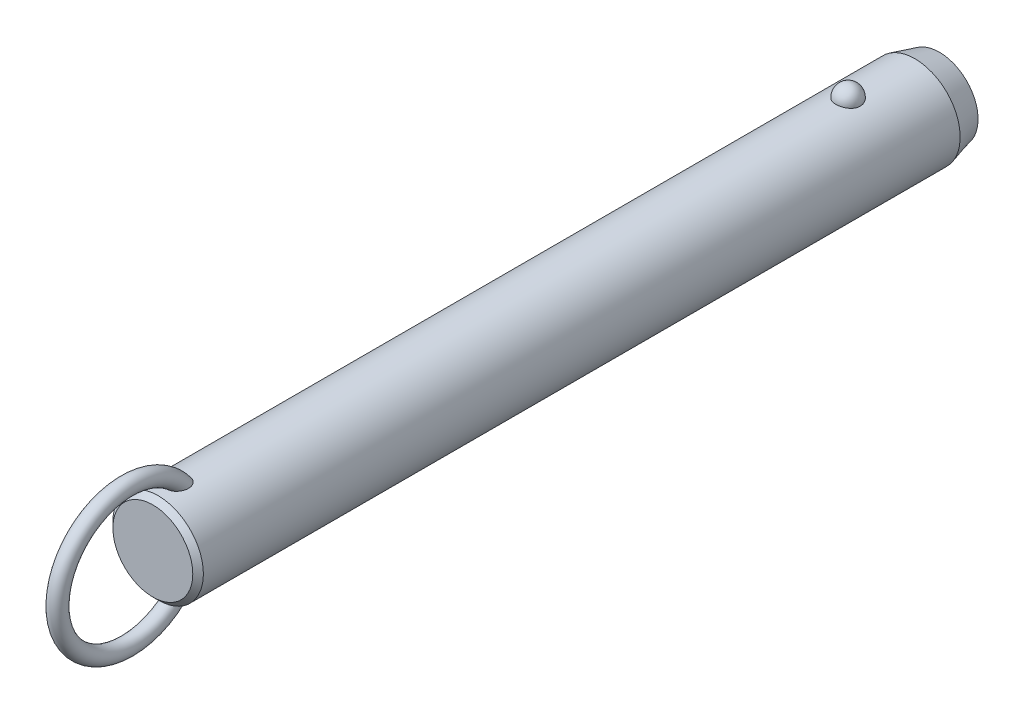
ISO-10303-21;
HEADER;
FILE_DESCRIPTION(('STEP AP214'),'2;1');
FILE_NAME('part.step','',(''),(''),'','','');
FILE_SCHEMA(('AUTOMOTIVE_DESIGN { 1 0 10303 214 1 1 1 1 }'));
ENDSEC;
DATA;
#1=APPLICATION_CONTEXT('core data for automotive mechanical design processes');
#2=APPLICATION_PROTOCOL_DEFINITION('international standard','automotive_design',2000,#1);
#3=PRODUCT_CONTEXT('',#1,'mechanical');
#4=PRODUCT('Part','Part','',(#3));
#5=PRODUCT_RELATED_PRODUCT_CATEGORY('part','',(#4));
#6=PRODUCT_DEFINITION_FORMATION('','',#4);
#7=PRODUCT_DEFINITION_CONTEXT('part definition',#1,'design');
#8=PRODUCT_DEFINITION('design','',#6,#7);
#9=PRODUCT_DEFINITION_SHAPE('','',#8);
#10=(LENGTH_UNIT() NAMED_UNIT(*) SI_UNIT(.MILLI.,.METRE.));
#11=(NAMED_UNIT(*) PLANE_ANGLE_UNIT() SI_UNIT($,.RADIAN.));
#12=(NAMED_UNIT(*) SI_UNIT($,.STERADIAN.) SOLID_ANGLE_UNIT());
#13=UNCERTAINTY_MEASURE_WITH_UNIT(LENGTH_MEASURE(1.E-05),#10,'distance_accuracy_value','');
#14=(GEOMETRIC_REPRESENTATION_CONTEXT(3) GLOBAL_UNCERTAINTY_ASSIGNED_CONTEXT((#13)) GLOBAL_UNIT_ASSIGNED_CONTEXT((#10,
#11,#12)) REPRESENTATION_CONTEXT('',''));
#15=CARTESIAN_POINT('',(0.,0.,0.));
#16=DIRECTION('',(0.,0.,1.));
#17=DIRECTION('',(1.,0.,0.));
#18=AXIS2_PLACEMENT_3D('',#15,#16,#17);
#19=CARTESIAN_POINT('',(0.,0.,154.9));
#20=DIRECTION('',(0.,0.,-1.));
#21=DIRECTION('',(-1.,0.,0.));
#22=AXIS2_PLACEMENT_3D('',#19,#20,#21);
#23=CYLINDRICAL_SURFACE('',#22,11.1);
#24=CARTESIAN_POINT('',(2.9724815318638,10.6945945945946,-3.00000000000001));
#25=CARTESIAN_POINT('',(2.97247830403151,10.6945972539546,-2.8322505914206));
#26=CARTESIAN_POINT('',(2.95876598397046,10.6984356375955,-2.66445972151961));
#27=CARTESIAN_POINT('',(2.90424529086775,10.7133624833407,-2.3336238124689));
#28=CARTESIAN_POINT('',(2.8634252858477,10.7244540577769,-2.17058084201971));
#29=CARTESIAN_POINT('',(2.75573657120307,10.7526272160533,-1.85396767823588));
#30=CARTESIAN_POINT('',(2.68887937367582,10.7697061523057,-1.70039333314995));
#31=CARTESIAN_POINT('',(2.53079696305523,10.8079438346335,-1.4069159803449));
#32=CARTESIAN_POINT('',(2.43957264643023,10.8291024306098,-1.26701246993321));
#33=CARTESIAN_POINT('',(2.23458150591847,10.8732541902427,-1.00409565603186));
#34=CARTESIAN_POINT('',(2.12071295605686,10.8962553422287,-0.881162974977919));
#35=CARTESIAN_POINT('',(1.87365402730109,10.9414421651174,-0.656352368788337));
#36=CARTESIAN_POINT('',(1.74046358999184,10.9636278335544,-0.554474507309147));
#37=CARTESIAN_POINT('',(1.45872188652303,11.0046495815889,-0.374872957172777));
#38=CARTESIAN_POINT('',(1.31021276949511,11.0234944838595,-0.297085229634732));
#39=CARTESIAN_POINT('',(1.00170030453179,11.0557957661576,-0.167529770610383));
#40=CARTESIAN_POINT('',(0.841698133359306,11.0692526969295,-0.1157593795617));
#41=CARTESIAN_POINT('',(0.517607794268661,11.0890932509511,-0.0403925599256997));
#42=CARTESIAN_POINT('',(0.353633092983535,11.0955916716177,-0.0163383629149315));
#43=CARTESIAN_POINT('',(0.0238420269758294,11.1011989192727,0.00445177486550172));
#44=CARTESIAN_POINT('',(-0.141974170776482,11.1003084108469,0.00119017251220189));
#45=CARTESIAN_POINT('',(-0.468405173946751,11.0912990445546,-0.0323233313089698));
#46=CARTESIAN_POINT('',(-0.629059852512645,11.0832767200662,-0.062214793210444));
#47=CARTESIAN_POINT('',(-0.942937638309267,11.0609962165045,-0.147645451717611));
#48=CARTESIAN_POINT('',(-1.09616062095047,11.0467379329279,-0.203185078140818));
#49=CARTESIAN_POINT('',(-1.39181061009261,11.0134071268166,-0.338752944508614));
#50=CARTESIAN_POINT('',(-1.53417383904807,10.9943086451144,-0.418913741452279));
#51=CARTESIAN_POINT('',(-1.80342160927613,10.9533667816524,-0.601448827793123));
#52=CARTESIAN_POINT('',(-1.9303046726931,10.9315231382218,-0.703825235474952));
#53=CARTESIAN_POINT('',(-2.16747598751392,10.887005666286,-0.930091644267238));
#54=CARTESIAN_POINT('',(-2.27742774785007,10.8643239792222,-1.05433291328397));
#55=CARTESIAN_POINT('',(-2.47517316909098,10.8209886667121,-1.31966633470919));
#56=CARTESIAN_POINT('',(-2.56296538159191,10.8003351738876,-1.46075958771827));
#57=CARTESIAN_POINT('',(-2.71500300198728,10.7631304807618,-1.75753646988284));
#58=CARTESIAN_POINT('',(-2.77898901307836,10.7466250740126,-1.91335887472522));
#59=CARTESIAN_POINT('',(-2.88046189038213,10.7198747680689,-2.23391529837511));
#60=CARTESIAN_POINT('',(-2.91794947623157,10.709629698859,-2.3986490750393));
#61=CARTESIAN_POINT('',(-2.96537819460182,10.6965949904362,-2.73165170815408));
#62=CARTESIAN_POINT('',(-2.97542891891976,10.693775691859,-2.89990378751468));
#63=CARTESIAN_POINT('',(-2.96804271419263,10.6958279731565,-3.23575286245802));
#64=CARTESIAN_POINT('',(-2.95060646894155,10.7006993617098,-3.4033498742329));
#65=CARTESIAN_POINT('',(-2.88883358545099,10.71753912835,-3.73233906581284));
#66=CARTESIAN_POINT('',(-2.84462026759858,10.7294749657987,-3.89375610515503));
#67=CARTESIAN_POINT('',(-2.73050447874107,10.7590797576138,-4.20667949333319));
#68=CARTESIAN_POINT('',(-2.66060103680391,10.7767489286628,-4.35818546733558));
#69=CARTESIAN_POINT('',(-2.49642559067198,10.8159599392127,-4.64785421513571));
#70=CARTESIAN_POINT('',(-2.40203047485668,10.8375211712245,-4.78594458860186));
#71=CARTESIAN_POINT('',(-2.19143488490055,10.8820570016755,-5.04410382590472));
#72=CARTESIAN_POINT('',(-2.07523364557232,10.9050316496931,-5.16417205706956));
#73=CARTESIAN_POINT('',(-1.82361254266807,10.9499219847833,-5.3833483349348));
#74=CARTESIAN_POINT('',(-1.68812945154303,10.9718338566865,-5.48238464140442));
#75=CARTESIAN_POINT('',(-1.40191298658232,11.0120611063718,-5.65618873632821));
#76=CARTESIAN_POINT('',(-1.25118062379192,11.0303767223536,-5.73095813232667));
#77=CARTESIAN_POINT('',(-0.940570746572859,11.0611653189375,-5.85334725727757));
#78=CARTESIAN_POINT('',(-0.780821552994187,11.0737044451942,-5.90127578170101));
#79=CARTESIAN_POINT('',(-0.455204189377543,11.0918598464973,-5.96992976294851));
#80=CARTESIAN_POINT('',(-0.289336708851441,11.0974768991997,-5.99065827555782));
#81=CARTESIAN_POINT('',(0.0406846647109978,11.1011307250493,-6.00418773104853));
#82=CARTESIAN_POINT('',(0.204817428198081,11.099299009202,-5.9974731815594));
#83=CARTESIAN_POINT('',(0.5295530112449,11.088551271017,-5.95740317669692));
#84=CARTESIAN_POINT('',(0.69015594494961,11.0796354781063,-5.92404858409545));
#85=CARTESIAN_POINT('',(1.0027760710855,11.0557204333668,-5.83180084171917));
#86=CARTESIAN_POINT('',(1.15482001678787,11.0407414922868,-5.7729929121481));
#87=CARTESIAN_POINT('',(1.44678373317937,11.0062913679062,-5.63147366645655));
#88=CARTESIAN_POINT('',(1.58670279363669,10.9868199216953,-5.54876095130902));
#89=CARTESIAN_POINT('',(1.8527023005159,10.9451315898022,-5.36027644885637));
#90=CARTESIAN_POINT('',(1.97855158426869,10.9228788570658,-5.25418644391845));
#91=CARTESIAN_POINT('',(2.21080872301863,10.8782509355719,-5.02251354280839));
#92=CARTESIAN_POINT('',(2.31721312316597,10.8558757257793,-4.89692718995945));
#93=CARTESIAN_POINT('',(2.5094551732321,10.8130715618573,-4.62745408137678));
#94=CARTESIAN_POINT('',(2.59493284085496,10.7926798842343,-4.48330448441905));
#95=CARTESIAN_POINT('',(2.740862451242,10.7565495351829,-4.18236358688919));
#96=CARTESIAN_POINT('',(2.80132490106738,10.7408089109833,-4.02557762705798));
#97=CARTESIAN_POINT('',(2.88959070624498,10.7173718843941,-3.72475308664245));
#98=CARTESIAN_POINT('',(2.92062102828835,10.7088950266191,-3.58171216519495));
#99=CARTESIAN_POINT('',(2.96206765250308,10.6975052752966,-3.29245795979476));
#100=CARTESIAN_POINT('',(2.97248434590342,10.6945922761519,-3.14624473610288));
#101=CARTESIAN_POINT('',(2.9724815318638,10.6945945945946,-3.00000000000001));
#102=B_SPLINE_CURVE_WITH_KNOTS('',3,(#24,#25,#26,#27,#28,#29,#30,#31,#32,#33,#34,#35,#36,#37,
#38,#39,#40,#41,#42,#43,#44,#45,#46,#47,#48,#49,#50,#51,#52,#53,#54,#55,#56,#57,#58,#59,#60,#61,
#62,#63,#64,#65,#66,#67,#68,#69,#70,#71,#72,#73,#74,#75,#76,#77,#78,#79,#80,#81,#82,#83,#84,#85,
#86,#87,#88,#89,#90,#91,#92,#93,#94,#95,#96,#97,#98,#99,#100,#101),.UNSPECIFIED.,.T.,.F.,(4,2,2,
2,2,2,2,2,2,2,2,2,2,2,2,2,2,2,2,2,2,2,2,2,2,2,2,2,2,2,2,2,2,2,2,2,2,2,4),(0.,0.502722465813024,
1.00566079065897,1.5083769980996,2.01107471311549,2.51608392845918,3.02109467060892,
3.52475118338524,4.02835620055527,4.523518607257,5.0186364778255,5.50715297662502,
5.9956776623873,6.48688002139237,6.97812923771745,7.47814366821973,7.9781907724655,
8.48353712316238,8.9888697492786,9.49218093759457,9.99547960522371,10.4964777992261,
10.997494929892,11.5010810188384,12.0046847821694,12.5099796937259,13.0152411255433,
13.5145635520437,14.0138298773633,14.5043200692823,14.9947943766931,15.4836390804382,
15.9725123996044,16.4685040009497,16.9645836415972,17.4686765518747,17.972557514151,
18.410841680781,18.849117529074),.UNSPECIFIED.);
#103=CARTESIAN_POINT('',(2.9724815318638,10.6945945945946,-3.00000000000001));
#104=VERTEX_POINT('',#103);
#105=EDGE_CURVE('E41',#104,#104,#102,.T.);
#106=ORIENTED_EDGE('',*,*,#105,.T.);
#107=EDGE_LOOP('',(#106));
#108=FACE_BOUND('',#107,.T.);
#109=CARTESIAN_POINT('',(0.,0.,166.3));
#110=DIRECTION('',(0.,0.,1.));
#111=DIRECTION('',(1.,0.,0.));
#112=AXIS2_PLACEMENT_3D('',#109,#110,#111);
#113=CIRCLE('',#112,11.1);
#114=CARTESIAN_POINT('',(11.1,0.,166.3));
#115=VERTEX_POINT('',#114);
#116=EDGE_CURVE('E10',#115,#115,#113,.F.);
#117=ORIENTED_EDGE('',*,*,#116,.T.);
#118=EDGE_LOOP('',(#117));
#119=FACE_BOUND('',#118,.T.);
#120=CARTESIAN_POINT('',(-0.564520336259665,-11.0856356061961,158.557815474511));
#121=CARTESIAN_POINT('',(-0.667202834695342,-11.0804062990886,158.591283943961));
#122=CARTESIAN_POINT('',(-0.766875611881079,-11.0738877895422,158.633835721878));
#123=CARTESIAN_POINT('',(-0.957284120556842,-11.0590576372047,158.735419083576));
#124=CARTESIAN_POINT('',(-1.04801616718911,-11.0507452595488,158.79445742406));
#125=CARTESIAN_POINT('',(-1.21800952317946,-11.0333016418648,158.926529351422));
#126=CARTESIAN_POINT('',(-1.29730805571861,-11.0241732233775,158.999515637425));
#127=CARTESIAN_POINT('',(-1.44337665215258,-11.0060026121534,159.157037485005));
#128=CARTESIAN_POINT('',(-1.51014622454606,-10.9969604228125,159.241573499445));
#129=CARTESIAN_POINT('',(-1.63454620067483,-10.9791841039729,159.425521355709));
#130=CARTESIAN_POINT('',(-1.69127003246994,-10.9705107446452,159.525549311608));
#131=CARTESIAN_POINT('',(-1.7898078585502,-10.9548648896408,159.732790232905));
#132=CARTESIAN_POINT('',(-1.83161214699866,-10.9478935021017,159.840007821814));
#133=CARTESIAN_POINT('',(-1.91557028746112,-10.9335803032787,160.105408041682));
#134=CARTESIAN_POINT('',(-1.95040620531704,-10.9273269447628,160.265980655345));
#135=CARTESIAN_POINT('',(-1.99388326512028,-10.9194709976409,160.590697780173));
#136=CARTESIAN_POINT('',(-2.00248051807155,-10.9178762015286,160.754847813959));
#137=CARTESIAN_POINT('',(-1.99551615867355,-10.9191578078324,161.124650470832));
#138=CARTESIAN_POINT('',(-1.97322066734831,-10.9232807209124,161.330191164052));
#139=CARTESIAN_POINT('',(-1.91529761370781,-10.9335244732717,161.633595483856));
#140=CARTESIAN_POINT('',(-1.89184575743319,-10.9376266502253,161.734088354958));
#141=CARTESIAN_POINT('',(-1.83700674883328,-10.9469720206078,161.932855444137));
#142=CARTESIAN_POINT('',(-1.80562070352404,-10.9522150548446,162.031129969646));
#143=CARTESIAN_POINT('',(-1.73463055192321,-10.9636837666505,162.225914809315));
#144=CARTESIAN_POINT('',(-1.69493416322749,-10.9699202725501,162.322390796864));
#145=CARTESIAN_POINT('',(-1.60745141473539,-10.9830806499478,162.511626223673));
#146=CARTESIAN_POINT('',(-1.55966150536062,-10.9900048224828,162.604384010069));
#147=CARTESIAN_POINT('',(-1.45591812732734,-11.0042280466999,162.784690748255));
#148=CARTESIAN_POINT('',(-1.40000013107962,-11.0115253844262,162.872260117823));
#149=CARTESIAN_POINT('',(-1.27937470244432,-11.0261911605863,163.041029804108));
#150=CARTESIAN_POINT('',(-1.21467835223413,-11.0335594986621,163.12223795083));
#151=CARTESIAN_POINT('',(-1.08218150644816,-11.0473027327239,163.269001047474));
#152=CARTESIAN_POINT('',(-1.01522633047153,-11.0537063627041,163.335309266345));
#153=CARTESIAN_POINT('',(-0.872952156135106,-11.065850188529,163.458378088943));
#154=CARTESIAN_POINT('',(-0.797642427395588,-11.0715911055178,163.515149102));
#155=CARTESIAN_POINT('',(-0.651396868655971,-11.081071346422,163.607515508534));
#156=CARTESIAN_POINT('',(-0.581712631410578,-11.0849841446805,163.645049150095));
#157=CARTESIAN_POINT('',(-0.437066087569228,-11.0916271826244,163.708259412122));
#158=CARTESIAN_POINT('',(-0.362109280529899,-11.0943586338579,163.733948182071));
#159=CARTESIAN_POINT('',(-0.207828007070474,-11.0983242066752,163.771117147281));
#160=CARTESIAN_POINT('',(-0.12846771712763,-11.0995432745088,163.782454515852));
#161=CARTESIAN_POINT('',(0.0309101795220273,-11.1002423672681,163.788965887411));
#162=CARTESIAN_POINT('',(0.110927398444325,-11.0997233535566,163.784148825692));
#163=CARTESIAN_POINT('',(0.25640659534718,-11.097240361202,163.760959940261));
#164=CARTESIAN_POINT('',(0.322235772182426,-11.0955074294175,163.744754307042));
#165=CARTESIAN_POINT('',(0.450635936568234,-11.0910350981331,163.702600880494));
#166=CARTESIAN_POINT('',(0.513205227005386,-11.0882951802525,163.676648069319));
#167=CARTESIAN_POINT('',(0.662626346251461,-11.0805620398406,163.602607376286));
#168=CARTESIAN_POINT('',(0.747127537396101,-11.0751144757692,163.549845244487));
#169=CARTESIAN_POINT('',(0.906756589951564,-11.0631932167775,163.431720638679));
#170=CARTESIAN_POINT('',(0.981859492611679,-11.0567168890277,163.366325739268));
#171=CARTESIAN_POINT('',(1.10712207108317,-11.0447856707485,163.24226337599));
#172=CARTESIAN_POINT('',(1.15909566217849,-11.0394280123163,163.185383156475));
#173=CARTESIAN_POINT('',(1.25791923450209,-11.0286040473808,163.067327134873));
#174=CARTESIAN_POINT('',(1.30476642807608,-11.0231376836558,163.006149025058));
#175=CARTESIAN_POINT('',(1.43818612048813,-11.0068027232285,162.817305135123));
#176=CARTESIAN_POINT('',(1.51751767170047,-10.9960104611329,162.684453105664));
#177=CARTESIAN_POINT('',(1.63597546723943,-10.9788847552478,162.453137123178));
#178=CARTESIAN_POINT('',(1.67988876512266,-10.9722190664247,162.357053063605));
#179=CARTESIAN_POINT('',(1.75953241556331,-10.9597298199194,162.161431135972));
#180=CARTESIAN_POINT('',(1.79525967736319,-10.9539065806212,162.061891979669));
#181=CARTESIAN_POINT('',(1.85844731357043,-10.9433632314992,161.86021118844));
#182=CARTESIAN_POINT('',(1.8859107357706,-10.9386427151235,161.75807052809));
#183=CARTESIAN_POINT('',(1.93234324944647,-10.9305350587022,161.551819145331));
#184=CARTESIAN_POINT('',(1.95131065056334,-10.9271481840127,161.447708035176));
#185=CARTESIAN_POINT('',(1.99040203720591,-10.9201183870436,161.165458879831));
#186=CARTESIAN_POINT('',(2.00221217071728,-10.9179256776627,160.986037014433));
#187=CARTESIAN_POINT('',(1.99711676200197,-10.9188636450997,160.627713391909));
#188=CARTESIAN_POINT('',(1.98026150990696,-10.9219849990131,160.448811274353));
#189=CARTESIAN_POINT('',(1.92151657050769,-10.9324473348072,160.13645144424));
#190=CARTESIAN_POINT('',(1.88605081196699,-10.9386915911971,160.001759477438));
#191=CARTESIAN_POINT('',(1.79393020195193,-10.9541780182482,159.739966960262));
#192=CARTESIAN_POINT('',(1.73729868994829,-10.9634168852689,159.612858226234));
#193=CARTESIAN_POINT('',(1.61237037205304,-10.9824218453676,159.389418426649));
#194=CARTESIAN_POINT('',(1.54715374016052,-10.9918945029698,159.291345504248));
#195=CARTESIAN_POINT('',(1.40127026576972,-11.0114415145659,159.107434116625));
#196=CARTESIAN_POINT('',(1.32060742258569,-11.0215157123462,159.021592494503));
#197=CARTESIAN_POINT('',(1.1447478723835,-11.041168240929,158.865163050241));
#198=CARTESIAN_POINT('',(1.04947805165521,-11.0507437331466,158.794656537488));
#199=CARTESIAN_POINT('',(0.847278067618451,-11.0680789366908,158.672640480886));
#200=CARTESIAN_POINT('',(0.740351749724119,-11.0758392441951,158.621124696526));
#201=CARTESIAN_POINT('',(0.529289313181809,-11.0878275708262,158.543485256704));
#202=CARTESIAN_POINT('',(0.425895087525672,-11.0923259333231,158.515377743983));
#203=CARTESIAN_POINT('',(0.215723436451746,-11.0984001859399,158.477703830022));
#204=CARTESIAN_POINT('',(0.10894793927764,-11.0999777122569,158.468127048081));
#205=CARTESIAN_POINT('',(-0.0938962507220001,-11.1000196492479,158.467877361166));
#206=CARTESIAN_POINT('',(-0.189967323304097,-11.0987797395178,158.475408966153));
#207=CARTESIAN_POINT('',(-0.379657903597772,-11.0939111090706,158.505507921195));
#208=CARTESIAN_POINT('',(-0.473277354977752,-11.0902823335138,158.528075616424));
#209=CARTESIAN_POINT('',(-0.564520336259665,-11.0856356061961,158.557815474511));
#210=B_SPLINE_CURVE_WITH_KNOTS('',3,(#120,#121,#122,#123,#124,#125,#126,#127,#128,#129,#130,
#131,#132,#133,#134,#135,#136,#137,#138,#139,#140,#141,#142,#143,#144,#145,#146,#147,#148,#149,
#150,#151,#152,#153,#154,#155,#156,#157,#158,#159,#160,#161,#162,#163,#164,#165,#166,#167,#168,
#169,#170,#171,#172,#173,#174,#175,#176,#177,#178,#179,#180,#181,#182,#183,#184,#185,#186,#187,
#188,#189,#190,#191,#192,#193,#194,#195,#196,#197,#198,#199,#200,#201,#202,#203,#204,#205,#206,
#207,#208,#209),.UNSPECIFIED.,.T.,.F.,(4,2,2,2,2,2,2,2,2,2,2,2,2,2,2,2,2,2,2,2,2,2,2,2,2,2,2,2,
2,2,2,2,2,2,2,2,2,2,2,2,2,2,2,2,4),(0.,0.323999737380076,0.648132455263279,0.971184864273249,
1.29424994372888,1.63886237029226,1.98369857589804,2.47426059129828,2.96564271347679,
3.58257396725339,3.89215258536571,4.20168803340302,4.51486273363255,4.82817514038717,
5.14015911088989,5.45175282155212,5.73442856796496,6.01679375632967,6.25364580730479,
6.49025437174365,6.72919963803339,6.96801276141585,7.17061258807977,7.37331685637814,
7.67094989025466,7.96935728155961,8.20075067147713,8.43226927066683,8.89581623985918,
9.21306533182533,9.5304340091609,9.84768549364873,10.1650000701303,10.7022930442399,
11.2386443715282,11.655339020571,12.071575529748,12.4245637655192,12.7774607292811,
13.1321855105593,13.4867936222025,13.8068771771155,14.1267813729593,14.4146787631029,
14.7025827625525),.UNSPECIFIED.);
#211=CARTESIAN_POINT('',(-0.564520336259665,-11.0856356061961,158.557815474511));
#212=VERTEX_POINT('',#211);
#213=EDGE_CURVE('E60',#212,#212,#210,.T.);
#214=ORIENTED_EDGE('',*,*,#213,.T.);
#215=EDGE_LOOP('',(#214));
#216=FACE_BOUND('',#215,.T.);
#217=CARTESIAN_POINT('',(-0.564520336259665,11.0856356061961,158.557815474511));
#218=CARTESIAN_POINT('',(-0.468542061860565,11.0905203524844,158.526545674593));
#219=CARTESIAN_POINT('',(-0.369793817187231,11.0942886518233,158.503157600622));
#220=CARTESIAN_POINT('',(-0.169555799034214,11.0991586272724,158.473085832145));
#221=CARTESIAN_POINT('',(-0.0680604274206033,11.1002543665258,158.46643932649));
#222=CARTESIAN_POINT('',(0.13454973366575,11.099646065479,158.470157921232));
#223=CARTESIAN_POINT('',(0.235664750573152,11.0979441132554,158.48051033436));
#224=CARTESIAN_POINT('',(0.434632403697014,11.0919342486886,158.517831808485));
#225=CARTESIAN_POINT('',(0.532486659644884,11.0876276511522,158.544792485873));
#226=CARTESIAN_POINT('',(0.722445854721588,11.0768742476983,158.6144096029));
#227=CARTESIAN_POINT('',(0.814543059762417,11.0704246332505,158.657086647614));
#228=CARTESIAN_POINT('',(0.990565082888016,11.0560659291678,158.756648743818));
#229=CARTESIAN_POINT('',(1.07448844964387,11.048156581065,158.813536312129));
#230=CARTESIAN_POINT('',(1.23562672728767,11.0313221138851,158.942210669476));
#231=CARTESIAN_POINT('',(1.3124268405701,11.0223686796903,159.014511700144));
#232=CARTESIAN_POINT('',(1.45398030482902,11.0045918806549,159.170042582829));
#233=CARTESIAN_POINT('',(1.51873073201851,10.9957685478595,159.253275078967));
#234=CARTESIAN_POINT('',(1.64107232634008,10.9782087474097,159.436384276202));
#235=CARTESIAN_POINT('',(1.6974317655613,10.9695572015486,159.537089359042));
#236=CARTESIAN_POINT('',(1.79515063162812,10.9539887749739,159.745626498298));
#237=CARTESIAN_POINT('',(1.83649966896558,10.9470730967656,159.85346343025));
#238=CARTESIAN_POINT('',(1.91931148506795,10.9329211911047,160.120399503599));
#239=CARTESIAN_POINT('',(1.95340104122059,10.9267904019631,160.281861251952));
#240=CARTESIAN_POINT('',(1.99526195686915,10.9192174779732,160.60821631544));
#241=CARTESIAN_POINT('',(2.00298989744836,10.9177830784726,160.77311484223));
#242=CARTESIAN_POINT('',(1.99396251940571,10.9194420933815,161.144100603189));
#243=CARTESIAN_POINT('',(1.97050829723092,10.923774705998,161.35003871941));
#244=CARTESIAN_POINT('',(1.91079643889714,10.9343131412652,161.653901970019));
#245=CARTESIAN_POINT('',(1.88673702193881,10.9385106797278,161.754529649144));
#246=CARTESIAN_POINT('',(1.83065508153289,10.9480376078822,161.953510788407));
#247=CARTESIAN_POINT('',(1.79863369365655,10.9533668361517,162.051864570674));
#248=CARTESIAN_POINT('',(1.72633365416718,10.9649954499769,162.246720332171));
#249=CARTESIAN_POINT('',(1.68596409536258,10.9713053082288,162.34318790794));
#250=CARTESIAN_POINT('',(1.59707998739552,10.9845964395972,162.532323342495));
#251=CARTESIAN_POINT('',(1.54856169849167,10.9915780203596,162.624989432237));
#252=CARTESIAN_POINT('',(1.44330168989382,11.0058935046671,162.804975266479));
#253=CARTESIAN_POINT('',(1.3865974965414,11.0132257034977,162.892316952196));
#254=CARTESIAN_POINT('',(1.2643115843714,11.0279330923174,163.060456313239));
#255=CARTESIAN_POINT('',(1.19874160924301,11.0353082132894,163.141262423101));
#256=CARTESIAN_POINT('',(1.06542088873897,11.048931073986,163.285985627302));
#257=CARTESIAN_POINT('',(0.998640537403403,11.0552153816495,163.350784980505));
#258=CARTESIAN_POINT('',(0.856896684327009,11.0671032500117,163.470846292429));
#259=CARTESIAN_POINT('',(0.781942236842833,11.0727075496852,163.526118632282));
#260=CARTESIAN_POINT('',(0.636276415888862,11.081949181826,163.615972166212));
#261=CARTESIAN_POINT('',(0.566755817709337,11.0857572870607,163.652441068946));
#262=CARTESIAN_POINT('',(0.42260242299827,11.0921860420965,163.713533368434));
#263=CARTESIAN_POINT('',(0.347974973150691,11.0948079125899,163.738168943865));
#264=CARTESIAN_POINT('',(0.194593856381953,11.0985608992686,163.773323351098));
#265=CARTESIAN_POINT('',(0.115807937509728,11.0996777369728,163.783706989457));
#266=CARTESIAN_POINT('',(-0.0422499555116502,11.1002003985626,163.788574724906));
#267=CARTESIAN_POINT('',(-0.121521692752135,11.09960699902,163.783066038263));
#268=CARTESIAN_POINT('',(-0.266046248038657,11.0970123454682,163.758827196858));
#269=CARTESIAN_POINT('',(-0.331661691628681,11.0952283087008,163.742135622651));
#270=CARTESIAN_POINT('',(-0.45958809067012,11.0906663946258,163.699111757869));
#271=CARTESIAN_POINT('',(-0.52189737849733,11.0878880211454,163.672774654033));
#272=CARTESIAN_POINT('',(-0.671446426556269,11.0800342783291,163.597513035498));
#273=CARTESIAN_POINT('',(-0.756250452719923,11.0744969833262,163.543818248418));
#274=CARTESIAN_POINT('',(-0.916349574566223,11.0624045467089,163.423802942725));
#275=CARTESIAN_POINT('',(-0.991618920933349,11.0558467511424,163.357449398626));
#276=CARTESIAN_POINT('',(-1.11713140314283,11.0437783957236,163.231633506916));
#277=CARTESIAN_POINT('',(-1.16920539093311,11.0383619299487,163.173952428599));
#278=CARTESIAN_POINT('',(-1.26817476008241,11.02743010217,163.054280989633));
#279=CARTESIAN_POINT('',(-1.31506731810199,11.0219146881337,162.992288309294));
#280=CARTESIAN_POINT('',(-1.40399813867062,11.0109399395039,162.864784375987));
#281=CARTESIAN_POINT('',(-1.44602864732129,11.0054807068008,162.799267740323));
#282=CARTESIAN_POINT('',(-1.52538779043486,10.9947621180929,162.665422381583));
#283=CARTESIAN_POINT('',(-1.56271516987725,10.9895028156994,162.597092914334));
#284=CARTESIAN_POINT('',(-1.64537943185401,10.9774790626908,162.433210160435));
#285=CARTESIAN_POINT('',(-1.68879497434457,10.9708503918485,162.3366735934));
#286=CARTESIAN_POINT('',(-1.76740738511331,10.9584602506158,162.140236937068));
#287=CARTESIAN_POINT('',(-1.80260120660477,10.95269910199,162.04033561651));
#288=CARTESIAN_POINT('',(-1.86468657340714,10.9423003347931,161.837966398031));
#289=CARTESIAN_POINT('',(-1.8915816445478,10.9376622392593,161.735499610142));
#290=CARTESIAN_POINT('',(-1.93682458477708,10.9297405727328,161.528642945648));
#291=CARTESIAN_POINT('',(-1.95517082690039,10.9264572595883,161.424252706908));
#292=CARTESIAN_POINT('',(-1.99232562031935,10.9197647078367,161.14262876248));
#293=CARTESIAN_POINT('',(-2.00294603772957,10.9177914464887,160.964185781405));
#294=CARTESIAN_POINT('',(-1.99566675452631,10.9191290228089,160.607996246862));
#295=CARTESIAN_POINT('',(-1.97781651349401,10.9224306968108,160.43024902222));
#296=CARTESIAN_POINT('',(-1.91747214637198,10.9331592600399,160.119792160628));
#297=CARTESIAN_POINT('',(-1.88131022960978,10.9395108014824,159.985825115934));
#298=CARTESIAN_POINT('',(-1.78790380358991,10.9551659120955,159.72559757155));
#299=CARTESIAN_POINT('',(-1.73068309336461,10.9644661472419,159.599328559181));
#300=CARTESIAN_POINT('',(-1.60475573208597,10.9835398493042,159.37741565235));
#301=CARTESIAN_POINT('',(-1.53908879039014,10.9930297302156,159.280026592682));
#302=CARTESIAN_POINT('',(-1.39238608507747,11.0125708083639,159.097525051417));
#303=CARTESIAN_POINT('',(-1.31135150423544,11.0226219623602,159.012411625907));
#304=CARTESIAN_POINT('',(-1.14382035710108,11.0411991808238,158.86529943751));
#305=CARTESIAN_POINT('',(-1.0585850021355,11.0497792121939,158.80186930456));
#306=CARTESIAN_POINT('',(-0.878723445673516,11.0655285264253,158.690250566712));
#307=CARTESIAN_POINT('',(-0.784123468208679,11.0727015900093,158.642020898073));
#308=CARTESIAN_POINT('',(-0.646163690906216,11.0812501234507,158.586023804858));
#309=CARTESIAN_POINT('',(-0.605595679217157,11.0835451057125,158.571197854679));
#310=CARTESIAN_POINT('',(-0.564520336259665,11.0856356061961,158.557815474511));
#311=B_SPLINE_CURVE_WITH_KNOTS('',3,(#217,#218,#219,#220,#221,#222,#223,#224,#225,#226,#227,
#228,#229,#230,#231,#232,#233,#234,#235,#236,#237,#238,#239,#240,#241,#242,#243,#244,#245,#246,
#247,#248,#249,#250,#251,#252,#253,#254,#255,#256,#257,#258,#259,#260,#261,#262,#263,#264,#265,
#266,#267,#268,#269,#270,#271,#272,#273,#274,#275,#276,#277,#278,#279,#280,#281,#282,#283,#284,
#285,#286,#287,#288,#289,#290,#291,#292,#293,#294,#295,#296,#297,#298,#299,#300,#301,#302,#303,
#304,#305,#306,#307,#308,#309,#310),.UNSPECIFIED.,.T.,.F.,(4,2,2,2,2,2,2,2,2,2,2,2,2,2,2,2,2,2,
2,2,2,2,2,2,2,2,2,2,2,2,2,2,2,2,2,2,2,2,2,2,2,2,2,2,2,2,4),(0.,0.303061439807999,
0.606795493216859,0.910302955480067,1.21365733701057,1.51741085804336,1.82121821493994,
2.13745205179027,2.45376252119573,2.79958678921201,3.14564996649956,3.63832391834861,
4.13180893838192,4.75031912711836,5.06071926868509,5.37107516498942,5.68500772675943,
5.99908475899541,6.31176519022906,6.62403542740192,6.90315673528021,7.18197194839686,
7.41687778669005,7.65154134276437,7.88841587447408,8.12518286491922,8.32752842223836,
8.52997509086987,8.82986421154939,9.13054668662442,9.36393502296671,9.59744991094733,
9.83133221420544,10.0652767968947,10.3830324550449,10.7009056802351,11.0186436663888,
11.3364420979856,11.8705925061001,12.4038159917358,12.8189662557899,13.2336487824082,
13.5857049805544,13.9377340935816,14.2561354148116,14.5736690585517,14.7033687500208),.UNSPECIFIED.);
#312=CARTESIAN_POINT('',(-0.564520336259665,11.0856356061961,158.557815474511));
#313=VERTEX_POINT('',#312);
#314=EDGE_CURVE('E68',#313,#313,#311,.T.);
#315=ORIENTED_EDGE('',*,*,#314,.T.);
#316=EDGE_LOOP('',(#315));
#317=FACE_BOUND('',#316,.T.);
#318=CARTESIAN_POINT('',(0.,0.,-19.3999999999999));
#319=DIRECTION('',(0.,0.,-1.));
#320=DIRECTION('',(-1.,0.,0.));
#321=AXIS2_PLACEMENT_3D('',#318,#319,#320);
#322=CIRCLE('',#321,11.1);
#323=CARTESIAN_POINT('',(-11.1,0.,-19.3999999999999));
#324=VERTEX_POINT('',#323);
#325=EDGE_CURVE('E57',#324,#324,#322,.F.);
#326=ORIENTED_EDGE('',*,*,#325,.T.);
#327=EDGE_LOOP('',(#326));
#328=FACE_BOUND('',#327,.T.);
#329=ADVANCED_FACE('F37',(#108,#119,#216,#317,#328),#23,.T.);
#330=CARTESIAN_POINT('',(0.,0.,-25.4));
#331=DIRECTION('',(0.,0.,-1.));
#332=DIRECTION('',(-1.,0.,0.));
#333=AXIS2_PLACEMENT_3D('',#330,#331,#332);
#334=PLANE('',#333);
#335=CARTESIAN_POINT('',(0.,0.,-25.4));
#336=DIRECTION('',(0.,0.,-1.));
#337=DIRECTION('',(-1.,0.,0.));
#338=AXIS2_PLACEMENT_3D('',#335,#336,#337);
#339=CIRCLE('',#338,9.49230484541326);
#340=CARTESIAN_POINT('',(-9.49230484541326,0.,-25.4));
#341=VERTEX_POINT('',#340);
#342=EDGE_CURVE('E67',#341,#341,#339,.T.);
#343=ORIENTED_EDGE('',*,*,#342,.T.);
#344=EDGE_LOOP('',(#343));
#345=FACE_BOUND('',#344,.T.);
#346=ADVANCED_FACE('F86',(#345),#334,.T.);
#347=CARTESIAN_POINT('',(0.,0.,-25.4));
#348=DIRECTION('',(0.,0.,1.));
#349=DIRECTION('',(1.,0.,0.));
#350=AXIS2_PLACEMENT_3D('',#347,#348,#349);
#351=CONICAL_SURFACE('',#350,9.49230484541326,0.261799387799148);
#352=ORIENTED_EDGE('',*,*,#325,.F.);
#353=EDGE_LOOP('',(#352));
#354=FACE_BOUND('',#353,.T.);
#355=ORIENTED_EDGE('',*,*,#342,.F.);
#356=EDGE_LOOP('',(#355));
#357=FACE_BOUND('',#356,.T.);
#358=ADVANCED_FACE('F84',(#354,#357),#351,.T.);
#359=CARTESIAN_POINT('',(0.,0.,167.6));
#360=DIRECTION('',(0.,0.,1.));
#361=DIRECTION('',(1.,0.,0.));
#362=AXIS2_PLACEMENT_3D('',#359,#360,#361);
#363=PLANE('',#362);
#364=CARTESIAN_POINT('',(0.,0.,167.6));
#365=DIRECTION('',(0.,0.,1.));
#366=DIRECTION('',(1.,0.,0.));
#367=AXIS2_PLACEMENT_3D('',#364,#365,#366);
#368=CIRCLE('',#367,9.8);
#369=CARTESIAN_POINT('',(9.8,0.,167.6));
#370=VERTEX_POINT('',#369);
#371=EDGE_CURVE('E50',#370,#370,#368,.T.);
#372=ORIENTED_EDGE('',*,*,#371,.T.);
#373=EDGE_LOOP('',(#372));
#374=FACE_BOUND('',#373,.T.);
#375=ADVANCED_FACE('F78',(#374),#363,.T.);
#376=CARTESIAN_POINT('',(0.,0.,173.95));
#377=DIRECTION('',(1.,0.,0.));
#378=DIRECTION('',(0.,0.,-1.));
#379=AXIS2_PLACEMENT_3D('',#376,#377,#378);
#380=TOROIDAL_SURFACE('',#379,17.05,2.);
#381=ORIENTED_EDGE('',*,*,#314,.F.);
#382=EDGE_LOOP('',(#381));
#383=FACE_BOUND('',#382,.T.);
#384=ORIENTED_EDGE('',*,*,#213,.F.);
#385=EDGE_LOOP('',(#384));
#386=FACE_BOUND('',#385,.T.);
#387=ADVANCED_FACE('F74',(#383,#386),#380,.T.);
#388=CARTESIAN_POINT('',(0.,0.,167.6));
#389=DIRECTION('',(0.,0.,-1.));
#390=DIRECTION('',(-1.,0.,0.));
#391=AXIS2_PLACEMENT_3D('',#388,#389,#390);
#392=CONICAL_SURFACE('',#391,9.8,0.785398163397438);
#393=ORIENTED_EDGE('',*,*,#116,.F.);
#394=EDGE_LOOP('',(#393));
#395=FACE_BOUND('',#394,.T.);
#396=ORIENTED_EDGE('',*,*,#371,.F.);
#397=EDGE_LOOP('',(#396));
#398=FACE_BOUND('',#397,.T.);
#399=ADVANCED_FACE('F39',(#395,#398),#392,.T.);
#400=CARTESIAN_POINT('',(0.,11.1,-3.00000000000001));
#401=DIRECTION('',(0.,1.,0.));
#402=DIRECTION('',(0.,0.,-1.));
#403=AXIS2_PLACEMENT_3D('',#400,#401,#402);
#404=SPHERICAL_SURFACE('',#403,3.);
#405=ORIENTED_EDGE('',*,*,#105,.F.);
#406=EDGE_LOOP('',(#405));
#407=FACE_BOUND('',#406,.T.);
#408=ADVANCED_FACE('F80',(#407),#404,.T.);
#409=CLOSED_SHELL('',(#329,#346,#358,#375,#387,#399,#408));
#410=MANIFOLD_SOLID_BREP('B2',#409);
#411=ADVANCED_BREP_SHAPE_REPRESENTATION('',(#18,#410),#14);
#412=SHAPE_DEFINITION_REPRESENTATION(#9,#411);
ENDSEC;
END-ISO-10303-21;
